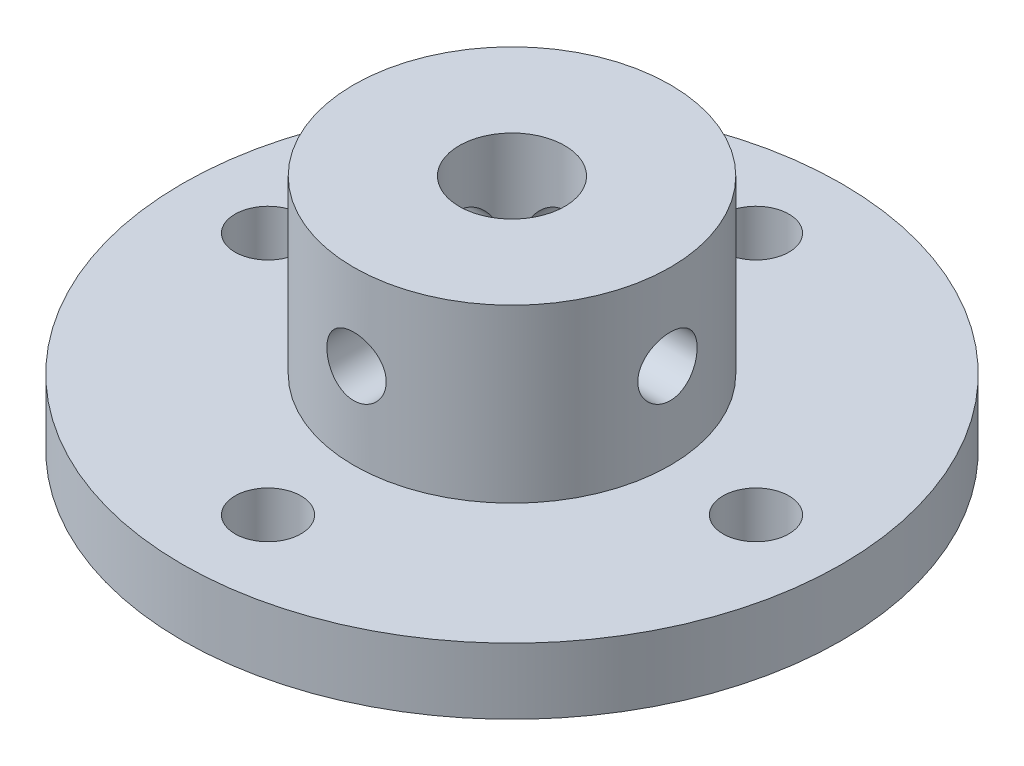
from build123d import *

# Parameters (mm, degrees)
SKETCH_1_R               = 25
EXTRUDE_1_DEPTH          = 5
SKETCH_2_R               = 12
EXTRUDE_2_DEPTH          = 13
SKETCH_3_R               = 4
CUT_EXTRUDE_1_DEPTH      = 40.67366885
SKETCH_4_R               = 2.5
CUT_EXTRUDE_2_DEPTH      = 38.669616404
CUT_EXTRUDE_3_DEPTH      = 40.67366885
CUT_EXTRUDE_3_DEPTH_BACK = 40.67366885
SKETCH_5_R               = 2.25
CUT_EXTRUDE_4_DEPTH      = 40.673668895
CUT_EXTRUDE_4_DEPTH_BACK = 40.673668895
SKETCH_6_R               = 2.25


with BuildPart() as part:
    # Sketch 1 → Extrude 1 (new body)
    with BuildSketch(Plane(origin=(0, 0, 0), x_dir=(1, 0, 0), z_dir=(0, 1, 0))):
        with Locations(Location((0, 0, 0), (0, 0, 270))):
            Circle(SKETCH_1_R)
    extrude(amount=EXTRUDE_1_DEPTH)

    # Sketch 2 → Extrude 2 (add)
    with BuildSketch(Plane(origin=(0, 5, 0), x_dir=(1, 0, 0), z_dir=(0, 1, 0))):
        with Locations(Location((0, 0, 0), (0, 0, 90))):
            Circle(SKETCH_2_R)
    extrude(amount=EXTRUDE_2_DEPTH)

    # Sketch 3 → Cut-Extrude 1 (cut, through all)
    with BuildSketch(Plane(origin=(0, 18, 0), x_dir=(1, 0, 0), z_dir=(0, 1, 0))):
        with Locations(Location((0, 0, 0), (0, 0, 270))):
            Circle(SKETCH_3_R)
    extrude(amount=-CUT_EXTRUDE_1_DEPTH, mode=Mode.SUBTRACT)

    # Sketch 4 → Cut-Extrude 2 (cut, through all)
    with BuildSketch(Plane(origin=(0, 5, 0), x_dir=(1, 0, 0), z_dir=(0, 1, 0))):
        with Locations(Location((0, 18.5, 0), (0, 0, 270))):
            Circle(SKETCH_4_R)
        with Locations(Location((18.5, 0, 0), (0, 0, 270))):
            Circle(SKETCH_4_R)
        with Locations(Location((0, -18.5, 0), (0, 0, 270))):
            Circle(SKETCH_4_R)
        with Locations(Location((-18.5, 0, 0), (0, 0, 270))):
            Circle(SKETCH_4_R)
    extrude(amount=-CUT_EXTRUDE_2_DEPTH, mode=Mode.SUBTRACT)

    # Sketch 5 → Cut-Extrude 3 (cut, two sides: drawn at the far end of the back side and taken through both)
    with BuildSketch(Plane(origin=(0, 0, 0), x_dir=(0, 0, -1), z_dir=(1, 0, 0)).offset(-CUT_EXTRUDE_3_DEPTH_BACK)):
        with Locations((0, 11.5)):
            Circle(SKETCH_5_R)
    extrude(amount=CUT_EXTRUDE_3_DEPTH + CUT_EXTRUDE_3_DEPTH_BACK, mode=Mode.SUBTRACT)

    # Sketch 6 → Cut-Extrude 4 (cut, two sides: drawn at the far end of the back side and taken through both)
    with BuildSketch(Plane.XY.offset(-CUT_EXTRUDE_4_DEPTH_BACK)):
        with Locations((0, 11.5)):
            Circle(SKETCH_6_R)
    extrude(amount=CUT_EXTRUDE_4_DEPTH + CUT_EXTRUDE_4_DEPTH_BACK, mode=Mode.SUBTRACT)


solid = part.part
